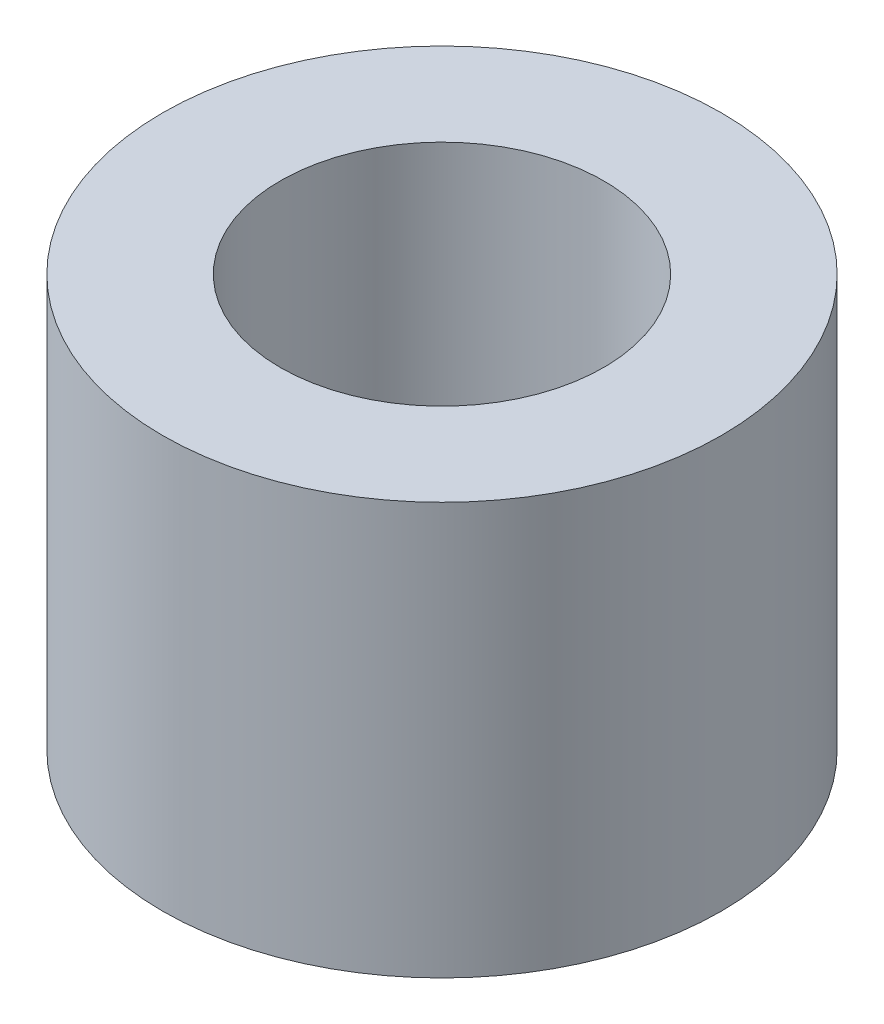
from build123d import *

# Parameters (mm, degrees)
SKETCH1_R           = 15.0749
SKETCH1_R_2         = 8.7249
BOSS_EXTRUDE1_DEPTH = 22.225


with BuildPart() as part:
    # Sketch1 → Boss-Extrude1 (new body)
    with BuildSketch(Plane(origin=(0, 0, 0), x_dir=(1, 0, 0), z_dir=(0, 1, 0))):
        with Locations(Location((0, 0, 0), (0, 0, 270))):
            Circle(SKETCH1_R)
        with Locations(Location((0, 0, 0), (0, 0, 270))):
            Circle(SKETCH1_R_2, mode=Mode.SUBTRACT)
    extrude(amount=BOSS_EXTRUDE1_DEPTH)


solid = part.part
